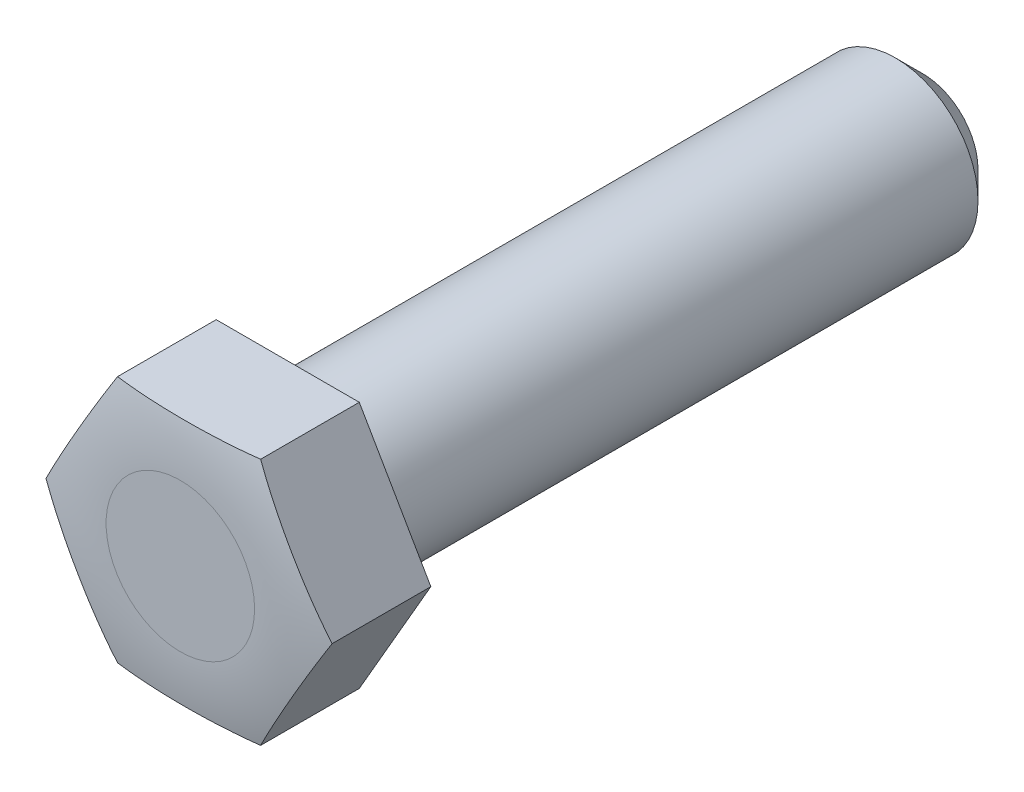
ISO-10303-21;
HEADER;
FILE_DESCRIPTION(('STEP AP214'),'2;1');
FILE_NAME('part.step','',(''),(''),'','','');
FILE_SCHEMA(('AUTOMOTIVE_DESIGN { 1 0 10303 214 1 1 1 1 }'));
ENDSEC;
DATA;
#1=APPLICATION_CONTEXT('core data for automotive mechanical design processes');
#2=APPLICATION_PROTOCOL_DEFINITION('international standard','automotive_design',2000,#1);
#3=PRODUCT_CONTEXT('',#1,'mechanical');
#4=PRODUCT('Part','Part','',(#3));
#5=PRODUCT_RELATED_PRODUCT_CATEGORY('part','',(#4));
#6=PRODUCT_DEFINITION_FORMATION('','',#4);
#7=PRODUCT_DEFINITION_CONTEXT('part definition',#1,'design');
#8=PRODUCT_DEFINITION('design','',#6,#7);
#9=PRODUCT_DEFINITION_SHAPE('','',#8);
#10=(LENGTH_UNIT() NAMED_UNIT(*) SI_UNIT(.MILLI.,.METRE.));
#11=(NAMED_UNIT(*) PLANE_ANGLE_UNIT() SI_UNIT($,.RADIAN.));
#12=(NAMED_UNIT(*) SI_UNIT($,.STERADIAN.) SOLID_ANGLE_UNIT());
#13=UNCERTAINTY_MEASURE_WITH_UNIT(LENGTH_MEASURE(1.E-05),#10,'distance_accuracy_value','');
#14=(GEOMETRIC_REPRESENTATION_CONTEXT(3) GLOBAL_UNCERTAINTY_ASSIGNED_CONTEXT((#13)) GLOBAL_UNIT_ASSIGNED_CONTEXT((#10,
#11,#12)) REPRESENTATION_CONTEXT('',''));
#15=CARTESIAN_POINT('',(0.,0.,0.));
#16=DIRECTION('',(0.,0.,1.));
#17=DIRECTION('',(1.,0.,0.));
#18=AXIS2_PLACEMENT_3D('',#15,#16,#17);
#19=CARTESIAN_POINT('',(-61.8038475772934,61.,17.9));
#20=DIRECTION('',(0.866025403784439,-0.5,0.));
#21=DIRECTION('',(0.5,0.866025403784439,0.));
#22=AXIS2_PLACEMENT_3D('',#19,#20,#21);
#23=PLANE('',#22);
#24=DIRECTION('',(0.,0.,1.));
#25=VECTOR('',#24,1.);
#26=CARTESIAN_POINT('',(-56.6076951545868,70.,17.9));
#27=LINE('',#26,#25);
#28=CARTESIAN_POINT('',(-56.6076951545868,70.,17.9));
#29=VERTEX_POINT('',#28);
#30=CARTESIAN_POINT('',(-56.6076951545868,70.,25.0649167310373));
#31=VERTEX_POINT('',#30);
#32=EDGE_CURVE('E105',#29,#31,#27,.T.);
#33=ORIENTED_EDGE('',*,*,#32,.T.);
#34=CARTESIAN_POINT('',(-56.6075796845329,70.0002,25.0648869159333));
#35=CARTESIAN_POINT('',(-56.8232832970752,69.6265903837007,25.1205548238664));
#36=CARTESIAN_POINT('',(-57.039514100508,69.2520676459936,25.1673620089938));
#37=CARTESIAN_POINT('',(-57.4726069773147,68.5019287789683,25.2453412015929));
#38=CARTESIAN_POINT('',(-57.6894687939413,68.1263130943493,25.2765188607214));
#39=CARTESIAN_POINT('',(-58.122809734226,67.3757445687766,25.3252784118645));
#40=CARTESIAN_POINT('',(-58.3392876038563,67.0007938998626,25.3429067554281));
#41=CARTESIAN_POINT('',(-58.7724340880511,66.2505621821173,25.366229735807));
#42=CARTESIAN_POINT('',(-58.9891027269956,65.8752810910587,25.3719225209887));
#43=CARTESIAN_POINT('',(-59.4224400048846,65.1247189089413,25.3719225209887));
#44=CARTESIAN_POINT('',(-59.6391086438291,64.7494378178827,25.366229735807));
#45=CARTESIAN_POINT('',(-60.0722551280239,63.9992061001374,25.3429067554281));
#46=CARTESIAN_POINT('',(-60.2887329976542,63.6242554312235,25.3252784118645));
#47=CARTESIAN_POINT('',(-60.7220739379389,62.8736869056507,25.2765188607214));
#48=CARTESIAN_POINT('',(-60.9389357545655,62.4980712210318,25.2453412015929));
#49=CARTESIAN_POINT('',(-61.3720286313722,61.7479323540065,25.1673620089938));
#50=CARTESIAN_POINT('',(-61.588259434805,61.3734096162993,25.1205548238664));
#51=CARTESIAN_POINT('',(-61.8039630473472,60.9998,25.0648869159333));
#52=B_SPLINE_CURVE_WITH_KNOTS('',3,(#34,#35,#36,#37,#38,#39,#40,#41,#42,#43,#44,#45,#46,#47,#48,
#49,#50,#51),.UNSPECIFIED.,.F.,.F.,(4,2,2,2,2,2,2,2,4),(0.,1.30473262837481,2.60899312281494,
3.90876198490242,5.20873247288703,6.50870296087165,7.80847182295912,9.11273231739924,
10.4174649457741),.UNSPECIFIED.);
#53=CARTESIAN_POINT('',(-61.8038475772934,61.,25.0649167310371));
#54=VERTEX_POINT('',#53);
#55=EDGE_CURVE('E45',#31,#54,#52,.T.);
#56=ORIENTED_EDGE('',*,*,#55,.T.);
#57=DIRECTION('',(0.,0.,1.));
#58=VECTOR('',#57,1.);
#59=CARTESIAN_POINT('',(-61.8038475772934,61.,17.9));
#60=LINE('',#59,#58);
#61=CARTESIAN_POINT('',(-61.8038475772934,61.,17.9));
#62=VERTEX_POINT('',#61);
#63=EDGE_CURVE('E52',#62,#54,#60,.T.);
#64=ORIENTED_EDGE('',*,*,#63,.F.);
#65=DIRECTION('',(0.5,0.866025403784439,0.));
#66=VECTOR('',#65,1.);
#67=CARTESIAN_POINT('',(-61.8038475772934,61.,17.9));
#68=LINE('',#67,#66);
#69=EDGE_CURVE('E152',#62,#29,#68,.T.);
#70=ORIENTED_EDGE('',*,*,#69,.T.);
#71=EDGE_LOOP('',(#33,#56,#64,#70));
#72=FACE_BOUND('',#71,.T.);
#73=ADVANCED_FACE('F30',(#72),#23,.T.);
#74=CARTESIAN_POINT('',(-72.1961524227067,61.,17.9));
#75=DIRECTION('',(0.,-1.,0.));
#76=DIRECTION('',(0.,0.,-1.));
#77=AXIS2_PLACEMENT_3D('',#74,#75,#76);
#78=PLANE('',#77);
#79=ORIENTED_EDGE('',*,*,#63,.T.);
#80=CARTESIAN_POINT('',(-67.,61.,25.3719225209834));
#81=CARTESIAN_POINT('',(-67.3831145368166,61.,25.371920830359));
#82=CARTESIAN_POINT('',(-67.766227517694,61.,25.3674640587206));
#83=CARTESIAN_POINT('',(-68.5322372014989,61.,25.349296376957));
#84=CARTESIAN_POINT('',(-68.9151339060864,61.,25.3355855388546));
#85=CARTESIAN_POINT('',(-69.6804102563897,61.,25.2979809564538));
#86=CARTESIAN_POINT('',(-70.0627899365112,61.,25.2740879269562));
#87=CARTESIAN_POINT('',(-70.8266516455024,61.,25.2147882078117));
#88=CARTESIAN_POINT('',(-71.2081337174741,61.,25.179382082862));
#89=CARTESIAN_POINT('',(-71.9675904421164,61.,25.0957858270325));
#90=CARTESIAN_POINT('',(-72.3455728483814,61.,25.0476670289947));
#91=CARTESIAN_POINT('',(-73.0994589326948,61.,24.9371088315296));
#92=CARTESIAN_POINT('',(-73.4753625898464,61.,24.8746692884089));
#93=CARTESIAN_POINT('',(-74.2241511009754,61.,24.7341924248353));
#94=CARTESIAN_POINT('',(-74.5970368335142,61.,24.6561598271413));
#95=CARTESIAN_POINT('',(-75.33889943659,61.,24.4834311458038));
#96=CARTESIAN_POINT('',(-75.7078765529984,61.,24.3887361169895));
#97=CARTESIAN_POINT('',(-76.6423851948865,61.,24.1249507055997));
#98=CARTESIAN_POINT('',(-77.2045186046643,61.,23.943572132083));
#99=CARTESIAN_POINT('',(-78.3126507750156,61.,23.5367792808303));
#100=CARTESIAN_POINT('',(-78.8586496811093,61.,23.311365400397));
#101=CARTESIAN_POINT('',(-79.930691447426,61.,22.8155216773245));
#102=CARTESIAN_POINT('',(-80.4567092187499,61.,22.5450373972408));
#103=CARTESIAN_POINT('',(-81.4834675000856,61.,21.9596505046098));
#104=CARTESIAN_POINT('',(-81.9842079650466,61.,21.6447478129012));
#105=CARTESIAN_POINT('',(-82.9578745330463,61.,20.9704606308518));
#106=CARTESIAN_POINT('',(-83.4306782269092,61.,20.6108991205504));
#107=CARTESIAN_POINT('',(-84.3418320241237,61.,19.8504295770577));
#108=CARTESIAN_POINT('',(-84.7801811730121,61.,19.44952039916));
#109=CARTESIAN_POINT('',(-85.6182007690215,61.,18.6092187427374));
#110=CARTESIAN_POINT('',(-86.0178764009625,61.,18.1698314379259));
#111=CARTESIAN_POINT('',(-86.7747727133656,61.,17.2559128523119));
#112=CARTESIAN_POINT('',(-87.1319965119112,61.,16.7813841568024));
#113=CARTESIAN_POINT('',(-87.7744455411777,61.,15.8393537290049));
#114=CARTESIAN_POINT('',(-88.0631146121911,61.,15.3741962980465));
#115=CARTESIAN_POINT('',(-88.5990929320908,61.,14.4206453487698));
#116=CARTESIAN_POINT('',(-88.8464044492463,61.,13.9322531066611));
#117=CARTESIAN_POINT('',(-89.2975706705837,61.,12.9359572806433));
#118=CARTESIAN_POINT('',(-89.5014375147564,61.,12.4280591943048));
#119=CARTESIAN_POINT('',(-89.8641178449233,61.,11.3964192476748));
#120=CARTESIAN_POINT('',(-90.0229317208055,61.,10.8726775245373));
#121=CARTESIAN_POINT('',(-90.2901757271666,61.,9.8290068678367));
#122=CARTESIAN_POINT('',(-90.3999574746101,61.,9.30942356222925));
#123=CARTESIAN_POINT('',(-90.5750009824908,61.,8.26281788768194));
#124=CARTESIAN_POINT('',(-90.6402638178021,61.,7.73579569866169));
#125=CARTESIAN_POINT('',(-90.7257621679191,61.,6.67810553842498));
#126=CARTESIAN_POINT('',(-90.7459971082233,61.,6.14743752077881));
#127=CARTESIAN_POINT('',(-90.7412799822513,61.,5.08630069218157));
#128=CARTESIAN_POINT('',(-90.7163279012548,61.,4.55583188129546));
#129=CARTESIAN_POINT('',(-90.6218282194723,61.,3.50334340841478));
#130=CARTESIAN_POINT('',(-90.5526540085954,61.,2.98129017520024));
#131=CARTESIAN_POINT('',(-90.3705940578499,61.,1.94486689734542));
#132=CARTESIAN_POINT('',(-90.2577086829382,61.,1.4304967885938));
#133=CARTESIAN_POINT('',(-89.9891181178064,61.,0.413164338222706));
#134=CARTESIAN_POINT('',(-89.8334207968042,61.,-0.0898000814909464));
#135=CARTESIAN_POINT('',(-89.4803911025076,61.,-1.08089675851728));
#136=CARTESIAN_POINT('',(-89.283058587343,61.,-1.56902896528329));
#137=CARTESIAN_POINT('',(-88.8478396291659,61.,-2.52802626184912));
#138=CARTESIAN_POINT('',(-88.6098738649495,61.,-2.99885534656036));
#139=CARTESIAN_POINT('',(-88.095484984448,61.,-3.91900696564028));
#140=CARTESIAN_POINT('',(-87.8190619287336,61.,-4.36832953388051));
#141=CARTESIAN_POINT('',(-87.2297265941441,61.,-5.24268247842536));
#142=CARTESIAN_POINT('',(-86.916796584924,61.,-5.66770090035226));
#143=CARTESIAN_POINT('',(-86.2569384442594,61.,-6.49046322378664));
#144=CARTESIAN_POINT('',(-85.9100099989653,61.,-6.88820687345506));
#145=CARTESIAN_POINT('',(-85.179478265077,61.,-7.65956878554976));
#146=CARTESIAN_POINT('',(-84.7954131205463,61.,-8.03274955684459));
#147=CARTESIAN_POINT('',(-83.9979563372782,61.,-8.74631547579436));
#148=CARTESIAN_POINT('',(-83.5845645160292,61.,-9.08670041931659));
#149=CARTESIAN_POINT('',(-82.7322049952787,61.,-9.73245105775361));
#150=CARTESIAN_POINT('',(-82.2932735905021,61.,-10.0378647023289));
#151=CARTESIAN_POINT('',(-81.3926104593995,61.,-10.6129287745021));
#152=CARTESIAN_POINT('',(-80.9308787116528,61.,-10.8825791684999));
#153=CARTESIAN_POINT('',(-79.9688158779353,61.,-11.3956077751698));
#154=CARTESIAN_POINT('',(-79.4676787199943,61.,-11.637473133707));
#155=CARTESIAN_POINT('',(-78.4481689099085,61.,-12.0816077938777));
#156=CARTESIAN_POINT('',(-77.9297950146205,61.,-12.2838742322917));
#157=CARTESIAN_POINT('',(-76.8782681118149,61.,-12.6500587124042));
#158=CARTESIAN_POINT('',(-76.3450810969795,61.,-12.8138786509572));
#159=CARTESIAN_POINT('',(-75.2688454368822,61.,-13.1043219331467));
#160=CARTESIAN_POINT('',(-74.7257985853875,61.,-13.2309519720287));
#161=CARTESIAN_POINT('',(-73.6713287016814,61.,-13.4423289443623));
#162=CARTESIAN_POINT('',(-73.1603631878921,61.,-13.5293927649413));
#163=CARTESIAN_POINT('',(-72.1345792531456,61.,-13.6772011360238));
#164=CARTESIAN_POINT('',(-71.6197599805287,61.,-13.737939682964));
#165=CARTESIAN_POINT('',(-70.5871586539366,61.,-13.8368617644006));
#166=CARTESIAN_POINT('',(-70.0693731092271,61.,-13.875007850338));
#167=CARTESIAN_POINT('',(-69.032804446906,61.,-13.9321559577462));
#168=CARTESIAN_POINT('',(-68.514021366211,61.,-13.9511586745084));
#169=CARTESIAN_POINT('',(-67.4750357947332,61.,-13.972435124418));
#170=CARTESIAN_POINT('',(-66.9548326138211,61.,-13.974673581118));
#171=CARTESIAN_POINT('',(-65.9145851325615,61.,-13.9626497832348));
#172=CARTESIAN_POINT('',(-65.394540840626,61.,-13.9483867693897));
#173=CARTESIAN_POINT('',(-64.3559103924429,61.,-13.9014862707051));
#174=CARTESIAN_POINT('',(-63.8373232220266,61.,-13.8688722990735));
#175=CARTESIAN_POINT('',(-62.80202652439,61.,-13.7819401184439));
#176=CARTESIAN_POINT('',(-62.2853166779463,61.,-13.7276257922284));
#177=CARTESIAN_POINT('',(-61.1415597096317,61.,-13.5787017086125));
#178=CARTESIAN_POINT('',(-60.5152953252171,61.,-13.477849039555));
#179=CARTESIAN_POINT('',(-59.2713731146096,61.,-13.2320656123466));
#180=CARTESIAN_POINT('',(-58.653714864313,61.,-13.087137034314));
#181=CARTESIAN_POINT('',(-57.4344737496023,61.,-12.74965285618));
#182=CARTESIAN_POINT('',(-56.8328301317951,61.,-12.5573188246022));
#183=CARTESIAN_POINT('',(-55.6479046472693,61.,-12.1222631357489));
#184=CARTESIAN_POINT('',(-55.0646238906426,61.,-11.8795384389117));
#185=CARTESIAN_POINT('',(-53.9159957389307,61.,-11.3401109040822));
#186=CARTESIAN_POINT('',(-53.3509012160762,61.,-11.0428676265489));
#187=CARTESIAN_POINT('',(-52.2509408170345,61.,-10.3967791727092));
#188=CARTESIAN_POINT('',(-51.7160756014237,61.,-10.0479328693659));
#189=CARTESIAN_POINT('',(-50.681121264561,61.,-9.29968096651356));
#190=CARTESIAN_POINT('',(-50.1811112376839,61.,-8.90016582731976));
#191=CARTESIAN_POINT('',(-49.2226364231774,61.,-8.05408618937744));
#192=CARTESIAN_POINT('',(-48.7641671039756,61.,-7.60752683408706));
#193=CARTESIAN_POINT('',(-47.9447257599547,61.,-6.72591983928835));
#194=CARTESIAN_POINT('',(-47.5786216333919,61.,-6.29562964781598));
#195=CARTESIAN_POINT('',(-46.8859036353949,61.,-5.40437743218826));
#196=CARTESIAN_POINT('',(-46.559286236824,61.,-4.9434181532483));
#197=CARTESIAN_POINT('',(-45.9487096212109,61.,-3.99476957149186));
#198=CARTESIAN_POINT('',(-45.6647046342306,61.,-3.50710972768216));
#199=CARTESIAN_POINT('',(-45.1414123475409,61.,-2.50835301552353));
#200=CARTESIAN_POINT('',(-44.902124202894,61.,-1.99725659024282));
#201=CARTESIAN_POINT('',(-44.4813599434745,61.,-0.982188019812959));
#202=CARTESIAN_POINT('',(-44.2975614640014,61.,-0.479176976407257));
#203=CARTESIAN_POINT('',(-43.9735907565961,61.,0.540691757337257));
#204=CARTESIAN_POINT('',(-43.833416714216,61.,1.05754887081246));
#205=CARTESIAN_POINT('',(-43.5977896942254,61.,2.10141541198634));
#206=CARTESIAN_POINT('',(-43.5023414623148,61.,2.62842591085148));
#207=CARTESIAN_POINT('',(-43.356945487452,61.,3.68869047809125));
#208=CARTESIAN_POINT('',(-43.3069977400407,61.,4.22194454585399));
#209=CARTESIAN_POINT('',(-43.2533993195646,61.,5.28285400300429));
#210=CARTESIAN_POINT('',(-43.2490743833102,61.,5.81047544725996));
#211=CARTESIAN_POINT('',(-43.2850049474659,61.,6.86419306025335));
#212=CARTESIAN_POINT('',(-43.3252598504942,61.,7.39028924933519));
#213=CARTESIAN_POINT('',(-43.4500341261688,61.,8.43716423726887));
#214=CARTESIAN_POINT('',(-43.5345501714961,61.,8.95794343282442));
#215=CARTESIAN_POINT('',(-43.7471930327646,61.,9.99052062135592));
#216=CARTESIAN_POINT('',(-43.875319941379,61.,10.5023185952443));
#217=CARTESIAN_POINT('',(-44.1739193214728,61.,11.5123724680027));
#218=CARTESIAN_POINT('',(-44.3443127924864,61.,12.0106517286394));
#219=CARTESIAN_POINT('',(-44.7262573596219,61.,12.9911722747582));
#220=CARTESIAN_POINT('',(-44.9378083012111,61.,13.4734136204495));
#221=CARTESIAN_POINT('',(-45.4004418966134,61.,14.4185216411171));
#222=CARTESIAN_POINT('',(-45.6515232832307,61.,14.8813889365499));
#223=CARTESIAN_POINT('',(-46.1913067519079,61.,15.7846364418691));
#224=CARTESIAN_POINT('',(-46.4800090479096,61.,16.2250165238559));
#225=CARTESIAN_POINT('',(-47.0953962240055,61.,17.0839568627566));
#226=CARTESIAN_POINT('',(-47.4223777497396,61.,17.5023045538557));
#227=CARTESIAN_POINT('',(-48.1098434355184,61.,18.3104888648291));
#228=CARTESIAN_POINT('',(-48.4703277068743,61.,18.7003253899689));
#229=CARTESIAN_POINT('',(-49.2221136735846,61.,19.4491830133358));
#230=CARTESIAN_POINT('',(-49.6134210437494,61.,19.8081984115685));
#231=CARTESIAN_POINT('',(-50.4238300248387,61.,20.4933292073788));
#232=CARTESIAN_POINT('',(-50.8429318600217,61.,20.8194443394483));
#233=CARTESIAN_POINT('',(-51.7174914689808,61.,21.4455655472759));
#234=CARTESIAN_POINT('',(-52.1736264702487,61.,21.744625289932));
#235=CARTESIAN_POINT('',(-53.1083878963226,61.,22.3051984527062));
#236=CARTESIAN_POINT('',(-53.587014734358,61.,22.5667111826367));
#237=CARTESIAN_POINT('',(-54.5625434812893,61.,23.0513493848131));
#238=CARTESIAN_POINT('',(-55.0594222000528,61.,23.2745216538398));
#239=CARTESIAN_POINT('',(-56.068468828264,61.,23.6830786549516));
#240=CARTESIAN_POINT('',(-56.5806371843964,61.,23.8684622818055));
#241=CARTESIAN_POINT('',(-57.495105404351,61.,24.1632828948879));
#242=CARTESIAN_POINT('',(-57.8949811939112,61.,24.2803330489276));
#243=CARTESIAN_POINT('',(-58.7002440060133,61.,24.4938128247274));
#244=CARTESIAN_POINT('',(-59.1056316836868,61.,24.5902399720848));
#245=CARTESIAN_POINT('',(-59.9207432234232,61.,24.7637019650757));
#246=CARTESIAN_POINT('',(-60.3304693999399,61.,24.8407258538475));
#247=CARTESIAN_POINT('',(-61.1528497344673,61.,24.9768635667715));
#248=CARTESIAN_POINT('',(-61.5655038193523,61.,25.0359778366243));
#249=CARTESIAN_POINT('',(-62.3953110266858,61.,25.1384395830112));
#250=CARTESIAN_POINT('',(-62.8124762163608,61.,25.1816880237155));
#251=CARTESIAN_POINT('',(-63.6480474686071,61.,25.2538918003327));
#252=CARTESIAN_POINT('',(-64.0664536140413,61.,25.2828461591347));
#253=CARTESIAN_POINT('',(-64.9039105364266,61.,25.3282846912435));
#254=CARTESIAN_POINT('',(-65.3229612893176,61.,25.3447693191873));
#255=CARTESIAN_POINT('',(-66.1613419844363,61.,25.3665891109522));
#256=CARTESIAN_POINT('',(-66.5806719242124,61.,25.3719243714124));
#257=CARTESIAN_POINT('',(-67.,61.,25.3719225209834));
#258=B_SPLINE_CURVE_WITH_KNOTS('',3,(#80,#81,#82,#83,#84,#85,#86,#87,#88,#89,#90,#91,#92,#93,
#94,#95,#96,#97,#98,#99,#100,#101,#102,#103,#104,#105,#106,#107,#108,#109,#110,#111,#112,#113,
#114,#115,#116,#117,#118,#119,#120,#121,#122,#123,#124,#125,#126,#127,#128,#129,#130,#131,#132,
#133,#134,#135,#136,#137,#138,#139,#140,#141,#142,#143,#144,#145,#146,#147,#148,#149,#150,#151,
#152,#153,#154,#155,#156,#157,#158,#159,#160,#161,#162,#163,#164,#165,#166,#167,#168,#169,#170,
#171,#172,#173,#174,#175,#176,#177,#178,#179,#180,#181,#182,#183,#184,#185,#186,#187,#188,#189,
#190,#191,#192,#193,#194,#195,#196,#197,#198,#199,#200,#201,#202,#203,#204,#205,#206,#207,#208,
#209,#210,#211,#212,#213,#214,#215,#216,#217,#218,#219,#220,#221,#222,#223,#224,#225,#226,#227,
#228,#229,#230,#231,#232,#233,#234,#235,#236,#237,#238,#239,#240,#241,#242,#243,#244,#245,#246,
#247,#248,#249,#250,#251,#252,#253,#254,#255,#256,#257),.UNSPECIFIED.,.T.,.F.,(4,2,2,2,2,2,2,2,
2,2,2,2,2,2,2,2,2,2,2,2,2,2,2,2,2,2,2,2,2,2,2,2,2,2,2,2,2,2,2,2,2,2,2,2,2,2,2,2,2,2,2,2,2,2,2,2,
2,2,2,2,2,2,2,2,2,2,2,2,2,2,2,2,2,2,2,2,2,2,2,2,2,2,2,2,2,2,2,2,4),(0.,1.14931363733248,
2.29861832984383,3.4478423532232,4.59701001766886,5.73986164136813,6.88272473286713,
8.0252422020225,9.16768736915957,10.9378625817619,12.7080218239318,14.4803348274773,
16.2526509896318,18.0322310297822,19.8118603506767,21.5912507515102,23.3705103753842,
25.0108451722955,26.651089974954,28.2908758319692,29.9306474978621,31.5219057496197,
33.1131255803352,34.704365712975,36.295606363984,37.8735856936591,39.4515518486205,
41.0292281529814,42.6069098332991,44.1877073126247,45.7685023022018,47.3500682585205,
48.9316488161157,50.5363415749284,52.1410443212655,53.7435198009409,55.3459967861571,
57.0135916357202,58.6813070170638,60.3532326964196,62.0248571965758,63.5790829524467,
65.1336629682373,66.6908126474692,68.2479057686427,69.8082745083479,71.36871504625,
72.9271607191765,74.4853276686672,76.3869317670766,78.2884418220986,80.1812275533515,
82.0741274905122,83.9869195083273,85.8997533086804,87.8167952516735,89.7336278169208,
91.4263690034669,93.1189588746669,94.8097175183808,96.5004442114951,98.1051289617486,
99.7097469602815,101.314535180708,102.919323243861,104.500360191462,106.081375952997,
107.662272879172,109.24317316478,110.821140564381,112.399102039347,113.977012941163,
115.554932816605,117.146010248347,118.737092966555,120.328469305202,121.919858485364,
123.554347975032,125.188867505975,126.821377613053,128.453935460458,129.70335847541,
130.952931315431,132.203208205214,133.453453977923,134.711376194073,135.969384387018,
137.227346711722,138.485298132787),.UNSPECIFIED.);
#259=CARTESIAN_POINT('',(-72.1961524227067,61.0000000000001,25.0649167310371));
#260=VERTEX_POINT('',#259);
#261=EDGE_CURVE('E153',#54,#260,#258,.T.);
#262=ORIENTED_EDGE('',*,*,#261,.T.);
#263=DIRECTION('',(0.,0.,1.));
#264=VECTOR('',#263,1.);
#265=CARTESIAN_POINT('',(-72.1961524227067,61.,17.9));
#266=LINE('',#265,#264);
#267=CARTESIAN_POINT('',(-72.1961524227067,61.,17.9));
#268=VERTEX_POINT('',#267);
#269=EDGE_CURVE('E217',#268,#260,#266,.T.);
#270=ORIENTED_EDGE('',*,*,#269,.F.);
#271=DIRECTION('',(1.,0.,0.));
#272=VECTOR('',#271,1.);
#273=CARTESIAN_POINT('',(-72.1961524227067,61.,17.9));
#274=LINE('',#273,#272);
#275=EDGE_CURVE('E109',#268,#62,#274,.T.);
#276=ORIENTED_EDGE('',*,*,#275,.T.);
#277=EDGE_LOOP('',(#79,#262,#270,#276));
#278=FACE_BOUND('',#277,.T.);
#279=ADVANCED_FACE('F131',(#278),#78,.T.);
#280=CARTESIAN_POINT('',(-77.3923048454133,70.,17.9));
#281=DIRECTION('',(-0.866025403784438,-0.500000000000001,0.));
#282=DIRECTION('',(0.500000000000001,-0.866025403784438,0.));
#283=AXIS2_PLACEMENT_3D('',#280,#281,#282);
#284=PLANE('',#283);
#285=ORIENTED_EDGE('',*,*,#269,.T.);
#286=CARTESIAN_POINT('',(-72.1960369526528,60.9998,25.0648869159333));
#287=CARTESIAN_POINT('',(-72.411740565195,61.3734096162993,25.1205548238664));
#288=CARTESIAN_POINT('',(-72.6279713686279,61.7479323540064,25.1673620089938));
#289=CARTESIAN_POINT('',(-73.0610642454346,62.4980712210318,25.2453412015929));
#290=CARTESIAN_POINT('',(-73.2779260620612,62.8736869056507,25.2765188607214));
#291=CARTESIAN_POINT('',(-73.7112670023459,63.6242554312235,25.3252784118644));
#292=CARTESIAN_POINT('',(-73.9277448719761,63.9992061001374,25.3429067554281));
#293=CARTESIAN_POINT('',(-74.360891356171,64.7494378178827,25.366229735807));
#294=CARTESIAN_POINT('',(-74.5775599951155,65.1247189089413,25.3719225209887));
#295=CARTESIAN_POINT('',(-75.0108972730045,65.8752810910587,25.3719225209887));
#296=CARTESIAN_POINT('',(-75.227565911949,66.2505621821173,25.366229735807));
#297=CARTESIAN_POINT('',(-75.6607123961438,67.0007938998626,25.3429067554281));
#298=CARTESIAN_POINT('',(-75.8771902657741,67.3757445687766,25.3252784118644));
#299=CARTESIAN_POINT('',(-76.3105312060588,68.1263130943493,25.2765188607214));
#300=CARTESIAN_POINT('',(-76.5273930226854,68.5019287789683,25.2453412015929));
#301=CARTESIAN_POINT('',(-76.960485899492,69.2520676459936,25.1673620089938));
#302=CARTESIAN_POINT('',(-77.1767167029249,69.6265903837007,25.1205548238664));
#303=CARTESIAN_POINT('',(-77.3924203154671,70.0002,25.0648869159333));
#304=B_SPLINE_CURVE_WITH_KNOTS('',3,(#286,#287,#288,#289,#290,#291,#292,#293,#294,#295,#296,
#297,#298,#299,#300,#301,#302,#303),.UNSPECIFIED.,.F.,.F.,(4,2,2,2,2,2,2,2,4),(0.,
1.30473262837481,2.60899312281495,3.90876198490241,5.20873247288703,6.50870296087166,
7.80847182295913,9.11273231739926,10.4174649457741),.UNSPECIFIED.);
#305=CARTESIAN_POINT('',(-77.3923048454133,70.,25.0649167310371));
#306=VERTEX_POINT('',#305);
#307=EDGE_CURVE('E178',#260,#306,#304,.T.);
#308=ORIENTED_EDGE('',*,*,#307,.T.);
#309=DIRECTION('',(0.,0.,1.));
#310=VECTOR('',#309,1.);
#311=CARTESIAN_POINT('',(-77.3923048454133,70.,17.9));
#312=LINE('',#311,#310);
#313=CARTESIAN_POINT('',(-77.3923048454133,70.,17.9));
#314=VERTEX_POINT('',#313);
#315=EDGE_CURVE('E107',#314,#306,#312,.T.);
#316=ORIENTED_EDGE('',*,*,#315,.F.);
#317=DIRECTION('',(0.500000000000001,-0.866025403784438,0.));
#318=VECTOR('',#317,1.);
#319=CARTESIAN_POINT('',(-77.3923048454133,70.,17.9));
#320=LINE('',#319,#318);
#321=EDGE_CURVE('E219',#314,#268,#320,.T.);
#322=ORIENTED_EDGE('',*,*,#321,.T.);
#323=EDGE_LOOP('',(#285,#308,#316,#322));
#324=FACE_BOUND('',#323,.T.);
#325=ADVANCED_FACE('F136',(#324),#284,.T.);
#326=CARTESIAN_POINT('',(-72.1961524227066,79.,17.9));
#327=DIRECTION('',(-0.866025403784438,0.500000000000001,0.));
#328=DIRECTION('',(-0.500000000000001,-0.866025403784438,0.));
#329=AXIS2_PLACEMENT_3D('',#326,#327,#328);
#330=PLANE('',#329);
#331=ORIENTED_EDGE('',*,*,#315,.T.);
#332=CARTESIAN_POINT('',(-77.3924203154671,69.9998,25.0648869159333));
#333=CARTESIAN_POINT('',(-77.1767167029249,70.3734096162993,25.1205548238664));
#334=CARTESIAN_POINT('',(-76.960485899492,70.7479323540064,25.1673620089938));
#335=CARTESIAN_POINT('',(-76.5273930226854,71.4980712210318,25.2453412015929));
#336=CARTESIAN_POINT('',(-76.3105312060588,71.8736869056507,25.2765188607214));
#337=CARTESIAN_POINT('',(-75.8771902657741,72.6242554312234,25.3252784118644));
#338=CARTESIAN_POINT('',(-75.6607123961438,72.9992061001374,25.3429067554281));
#339=CARTESIAN_POINT('',(-75.227565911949,73.7494378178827,25.366229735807));
#340=CARTESIAN_POINT('',(-75.0108972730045,74.1247189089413,25.3719225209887));
#341=CARTESIAN_POINT('',(-74.5775599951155,74.8752810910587,25.3719225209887));
#342=CARTESIAN_POINT('',(-74.360891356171,75.2505621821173,25.366229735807));
#343=CARTESIAN_POINT('',(-73.9277448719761,76.0007938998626,25.3429067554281));
#344=CARTESIAN_POINT('',(-73.7112670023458,76.3757445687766,25.3252784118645));
#345=CARTESIAN_POINT('',(-73.2779260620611,77.1263130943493,25.2765188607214));
#346=CARTESIAN_POINT('',(-73.0610642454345,77.5019287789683,25.2453412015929));
#347=CARTESIAN_POINT('',(-72.6279713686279,78.2520676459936,25.1673620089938));
#348=CARTESIAN_POINT('',(-72.411740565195,78.6265903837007,25.1205548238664));
#349=CARTESIAN_POINT('',(-72.1960369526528,79.0002,25.0648869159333));
#350=B_SPLINE_CURVE_WITH_KNOTS('',3,(#332,#333,#334,#335,#336,#337,#338,#339,#340,#341,#342,
#343,#344,#345,#346,#347,#348,#349),.UNSPECIFIED.,.F.,.F.,(4,2,2,2,2,2,2,2,4),(0.,
1.30473262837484,2.60899312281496,3.90876198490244,5.20873247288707,6.50870296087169,
7.80847182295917,9.11273231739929,10.4174649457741),.UNSPECIFIED.);
#351=CARTESIAN_POINT('',(-72.1961524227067,79.,25.0649167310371));
#352=VERTEX_POINT('',#351);
#353=EDGE_CURVE('E99',#306,#352,#350,.T.);
#354=ORIENTED_EDGE('',*,*,#353,.T.);
#355=DIRECTION('',(0.,0.,1.));
#356=VECTOR('',#355,1.);
#357=CARTESIAN_POINT('',(-72.1961524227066,79.,17.9));
#358=LINE('',#357,#356);
#359=CARTESIAN_POINT('',(-72.1961524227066,79.,17.9));
#360=VERTEX_POINT('',#359);
#361=EDGE_CURVE('E98',#360,#352,#358,.T.);
#362=ORIENTED_EDGE('',*,*,#361,.F.);
#363=DIRECTION('',(-0.500000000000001,-0.866025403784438,0.));
#364=VECTOR('',#363,1.);
#365=CARTESIAN_POINT('',(-72.1961524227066,79.,17.9));
#366=LINE('',#365,#364);
#367=EDGE_CURVE('E221',#360,#314,#366,.T.);
#368=ORIENTED_EDGE('',*,*,#367,.T.);
#369=EDGE_LOOP('',(#331,#354,#362,#368));
#370=FACE_BOUND('',#369,.T.);
#371=ADVANCED_FACE('F186',(#370),#330,.T.);
#372=CARTESIAN_POINT('',(-61.8038475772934,79.,17.9));
#373=DIRECTION('',(0.,1.,0.));
#374=DIRECTION('',(0.,0.,1.));
#375=AXIS2_PLACEMENT_3D('',#372,#373,#374);
#376=PLANE('',#375);
#377=ORIENTED_EDGE('',*,*,#361,.T.);
#378=CARTESIAN_POINT('',(-67.,79.,25.3719225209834));
#379=CARTESIAN_POINT('',(-66.6168854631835,79.,25.371920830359));
#380=CARTESIAN_POINT('',(-66.2337724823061,79.,25.3674640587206));
#381=CARTESIAN_POINT('',(-65.4677627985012,79.,25.349296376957));
#382=CARTESIAN_POINT('',(-65.0848660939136,79.,25.3355855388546));
#383=CARTESIAN_POINT('',(-64.3195897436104,79.,25.2979809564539));
#384=CARTESIAN_POINT('',(-63.9372100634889,79.,25.2740879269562));
#385=CARTESIAN_POINT('',(-63.1733483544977,79.,25.2147882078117));
#386=CARTESIAN_POINT('',(-62.791866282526,79.,25.1793820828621));
#387=CARTESIAN_POINT('',(-62.0324095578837,79.,25.0957858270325));
#388=CARTESIAN_POINT('',(-61.6544271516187,79.,25.0476670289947));
#389=CARTESIAN_POINT('',(-60.9005410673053,79.,24.9371088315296));
#390=CARTESIAN_POINT('',(-60.5246374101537,79.,24.8746692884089));
#391=CARTESIAN_POINT('',(-59.7758488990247,79.,24.7341924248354));
#392=CARTESIAN_POINT('',(-59.4029631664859,79.,24.6561598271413));
#393=CARTESIAN_POINT('',(-58.6611005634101,79.,24.4834311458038));
#394=CARTESIAN_POINT('',(-58.2921234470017,79.,24.3887361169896));
#395=CARTESIAN_POINT('',(-57.3576148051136,79.,24.1249507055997));
#396=CARTESIAN_POINT('',(-56.7954813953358,79.,23.943572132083));
#397=CARTESIAN_POINT('',(-55.6873492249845,79.,23.5367792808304));
#398=CARTESIAN_POINT('',(-55.1413503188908,79.,23.3113654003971));
#399=CARTESIAN_POINT('',(-54.0693085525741,79.,22.8155216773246));
#400=CARTESIAN_POINT('',(-53.5432907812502,79.,22.5450373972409));
#401=CARTESIAN_POINT('',(-52.5165324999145,79.,21.9596505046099));
#402=CARTESIAN_POINT('',(-52.0157920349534,79.,21.6447478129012));
#403=CARTESIAN_POINT('',(-51.0421254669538,79.,20.9704606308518));
#404=CARTESIAN_POINT('',(-50.5693217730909,79.,20.6108991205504));
#405=CARTESIAN_POINT('',(-49.6581679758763,79.,19.8504295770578));
#406=CARTESIAN_POINT('',(-49.219818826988,79.,19.4495203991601));
#407=CARTESIAN_POINT('',(-48.3817992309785,79.,18.6092187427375));
#408=CARTESIAN_POINT('',(-47.9821235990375,79.,18.169831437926));
#409=CARTESIAN_POINT('',(-47.2252272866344,79.,17.255912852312));
#410=CARTESIAN_POINT('',(-46.8680034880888,79.,16.7813841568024));
#411=CARTESIAN_POINT('',(-46.2255544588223,79.,15.839353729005));
#412=CARTESIAN_POINT('',(-45.9368853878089,79.,15.3741962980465));
#413=CARTESIAN_POINT('',(-45.4009070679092,79.,14.4206453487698));
#414=CARTESIAN_POINT('',(-45.1535955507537,79.,13.9322531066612));
#415=CARTESIAN_POINT('',(-44.7024293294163,79.,12.9359572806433));
#416=CARTESIAN_POINT('',(-44.4985624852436,79.,12.4280591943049));
#417=CARTESIAN_POINT('',(-44.1358821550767,79.,11.3964192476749));
#418=CARTESIAN_POINT('',(-43.9770682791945,79.,10.8726775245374));
#419=CARTESIAN_POINT('',(-43.7098242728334,79.,9.82900686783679));
#420=CARTESIAN_POINT('',(-43.6000425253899,79.,9.30942356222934));
#421=CARTESIAN_POINT('',(-43.4249990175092,79.,8.26281788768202));
#422=CARTESIAN_POINT('',(-43.3597361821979,79.,7.73579569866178));
#423=CARTESIAN_POINT('',(-43.2742378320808,79.,6.67810553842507));
#424=CARTESIAN_POINT('',(-43.2540028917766,79.,6.14743752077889));
#425=CARTESIAN_POINT('',(-43.2587200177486,79.,5.08630069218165));
#426=CARTESIAN_POINT('',(-43.2836720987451,79.,4.55583188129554));
#427=CARTESIAN_POINT('',(-43.3781717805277,79.,3.50334340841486));
#428=CARTESIAN_POINT('',(-43.4473459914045,79.,2.98129017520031));
#429=CARTESIAN_POINT('',(-43.6294059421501,79.,1.9448668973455));
#430=CARTESIAN_POINT('',(-43.7422913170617,79.,1.43049678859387));
#431=CARTESIAN_POINT('',(-44.0108818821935,79.,0.413164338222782));
#432=CARTESIAN_POINT('',(-44.1665792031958,79.,-0.0898000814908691));
#433=CARTESIAN_POINT('',(-44.5196088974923,79.,-1.0808967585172));
#434=CARTESIAN_POINT('',(-44.7169414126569,79.,-1.56902896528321));
#435=CARTESIAN_POINT('',(-45.152160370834,79.,-2.52802626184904));
#436=CARTESIAN_POINT('',(-45.3901261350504,79.,-2.99885534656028));
#437=CARTESIAN_POINT('',(-45.9045150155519,79.,-3.91900696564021));
#438=CARTESIAN_POINT('',(-46.1809380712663,79.,-4.36832953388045));
#439=CARTESIAN_POINT('',(-46.7702734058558,79.,-5.24268247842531));
#440=CARTESIAN_POINT('',(-47.0832034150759,79.,-5.6677009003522));
#441=CARTESIAN_POINT('',(-47.7430615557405,79.,-6.49046322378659));
#442=CARTESIAN_POINT('',(-48.0899900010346,79.,-6.88820687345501));
#443=CARTESIAN_POINT('',(-48.8205217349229,79.,-7.65956878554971));
#444=CARTESIAN_POINT('',(-49.2045868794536,79.,-8.03274955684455));
#445=CARTESIAN_POINT('',(-50.0020436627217,79.,-8.74631547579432));
#446=CARTESIAN_POINT('',(-50.4154354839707,79.,-9.08670041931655));
#447=CARTESIAN_POINT('',(-51.2677950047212,79.,-9.73245105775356));
#448=CARTESIAN_POINT('',(-51.7067264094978,79.,-10.0378647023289));
#449=CARTESIAN_POINT('',(-52.6073895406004,79.,-10.6129287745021));
#450=CARTESIAN_POINT('',(-53.0691212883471,79.,-10.8825791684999));
#451=CARTESIAN_POINT('',(-54.0311841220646,79.,-11.3956077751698));
#452=CARTESIAN_POINT('',(-54.5323212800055,79.,-11.6374731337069));
#453=CARTESIAN_POINT('',(-55.5518310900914,79.,-12.0816077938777));
#454=CARTESIAN_POINT('',(-56.0702049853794,79.,-12.2838742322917));
#455=CARTESIAN_POINT('',(-57.121731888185,79.,-12.6500587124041));
#456=CARTESIAN_POINT('',(-57.6549189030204,79.,-12.8138786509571));
#457=CARTESIAN_POINT('',(-58.7311545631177,79.,-13.1043219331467));
#458=CARTESIAN_POINT('',(-59.2742014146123,79.,-13.2309519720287));
#459=CARTESIAN_POINT('',(-60.3286712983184,79.,-13.4423289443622));
#460=CARTESIAN_POINT('',(-60.8396368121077,79.,-13.5293927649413));
#461=CARTESIAN_POINT('',(-61.8654207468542,79.,-13.6772011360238));
#462=CARTESIAN_POINT('',(-62.3802400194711,79.,-13.737939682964));
#463=CARTESIAN_POINT('',(-63.4128413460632,79.,-13.8368617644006));
#464=CARTESIAN_POINT('',(-63.9306268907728,79.,-13.875007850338));
#465=CARTESIAN_POINT('',(-64.9671955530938,79.,-13.9321559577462));
#466=CARTESIAN_POINT('',(-65.4859786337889,79.,-13.9511586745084));
#467=CARTESIAN_POINT('',(-66.5249642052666,79.,-13.972435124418));
#468=CARTESIAN_POINT('',(-67.0451673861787,79.,-13.974673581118));
#469=CARTESIAN_POINT('',(-68.0854148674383,79.,-13.9626497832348));
#470=CARTESIAN_POINT('',(-68.6054591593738,79.,-13.9483867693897));
#471=CARTESIAN_POINT('',(-69.6440896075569,79.,-13.9014862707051));
#472=CARTESIAN_POINT('',(-70.1626767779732,79.,-13.8688722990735));
#473=CARTESIAN_POINT('',(-71.1979734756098,79.,-13.7819401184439));
#474=CARTESIAN_POINT('',(-71.7146833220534,79.,-13.7276257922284));
#475=CARTESIAN_POINT('',(-72.8584402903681,79.,-13.5787017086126));
#476=CARTESIAN_POINT('',(-73.4847046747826,79.,-13.477849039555));
#477=CARTESIAN_POINT('',(-74.7286268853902,79.,-13.2320656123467));
#478=CARTESIAN_POINT('',(-75.3462851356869,79.,-13.0871370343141));
#479=CARTESIAN_POINT('',(-76.5655262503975,79.,-12.7496528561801));
#480=CARTESIAN_POINT('',(-77.1671698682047,79.,-12.5573188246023));
#481=CARTESIAN_POINT('',(-78.3520953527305,79.,-12.122263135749));
#482=CARTESIAN_POINT('',(-78.9353761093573,79.,-11.8795384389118));
#483=CARTESIAN_POINT('',(-80.0840042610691,79.,-11.3401109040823));
#484=CARTESIAN_POINT('',(-80.6490987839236,79.,-11.042867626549));
#485=CARTESIAN_POINT('',(-81.7490591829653,79.,-10.3967791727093));
#486=CARTESIAN_POINT('',(-82.2839243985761,79.,-10.047932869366));
#487=CARTESIAN_POINT('',(-83.3188787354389,79.,-9.29968096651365));
#488=CARTESIAN_POINT('',(-83.818888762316,79.,-8.90016582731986));
#489=CARTESIAN_POINT('',(-84.7773635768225,79.,-8.05408618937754));
#490=CARTESIAN_POINT('',(-85.2358328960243,79.,-7.60752683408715));
#491=CARTESIAN_POINT('',(-86.0552742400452,79.,-6.72591983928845));
#492=CARTESIAN_POINT('',(-86.4213783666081,79.,-6.29562964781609));
#493=CARTESIAN_POINT('',(-87.1140963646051,79.,-5.40437743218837));
#494=CARTESIAN_POINT('',(-87.4407137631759,79.,-4.9434181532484));
#495=CARTESIAN_POINT('',(-88.0512903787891,79.,-3.99476957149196));
#496=CARTESIAN_POINT('',(-88.3352953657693,79.,-3.50710972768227));
#497=CARTESIAN_POINT('',(-88.858587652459,79.,-2.50835301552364));
#498=CARTESIAN_POINT('',(-89.097875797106,79.,-1.99725659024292));
#499=CARTESIAN_POINT('',(-89.5186400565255,79.,-0.982188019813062));
#500=CARTESIAN_POINT('',(-89.7024385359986,79.,-0.479176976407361));
#501=CARTESIAN_POINT('',(-90.0264092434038,79.,0.54069175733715));
#502=CARTESIAN_POINT('',(-90.166583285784,79.,1.05754887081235));
#503=CARTESIAN_POINT('',(-90.4022103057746,79.,2.10141541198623));
#504=CARTESIAN_POINT('',(-90.4976585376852,79.,2.62842591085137));
#505=CARTESIAN_POINT('',(-90.6430545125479,79.,3.68869047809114));
#506=CARTESIAN_POINT('',(-90.6930022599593,79.,4.22194454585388));
#507=CARTESIAN_POINT('',(-90.7466006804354,79.,5.28285400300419));
#508=CARTESIAN_POINT('',(-90.7509256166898,79.,5.81047544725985));
#509=CARTESIAN_POINT('',(-90.7149950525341,79.,6.86419306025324));
#510=CARTESIAN_POINT('',(-90.6747401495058,79.,7.39028924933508));
#511=CARTESIAN_POINT('',(-90.5499658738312,79.,8.43716423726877));
#512=CARTESIAN_POINT('',(-90.4654498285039,79.,8.95794343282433));
#513=CARTESIAN_POINT('',(-90.2528069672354,79.,9.99052062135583));
#514=CARTESIAN_POINT('',(-90.124680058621,79.,10.5023185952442));
#515=CARTESIAN_POINT('',(-89.8260806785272,79.,11.5123724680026));
#516=CARTESIAN_POINT('',(-89.6556872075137,79.,12.0106517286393));
#517=CARTESIAN_POINT('',(-89.2737426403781,79.,12.9911722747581));
#518=CARTESIAN_POINT('',(-89.062191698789,79.,13.4734136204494));
#519=CARTESIAN_POINT('',(-88.5995581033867,79.,14.418521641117));
#520=CARTESIAN_POINT('',(-88.3484767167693,79.,14.8813889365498));
#521=CARTESIAN_POINT('',(-87.8086932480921,79.,15.784636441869));
#522=CARTESIAN_POINT('',(-87.5199909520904,79.,16.2250165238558));
#523=CARTESIAN_POINT('',(-86.9046037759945,79.,17.0839568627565));
#524=CARTESIAN_POINT('',(-86.5776222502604,79.,17.5023045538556));
#525=CARTESIAN_POINT('',(-85.8901565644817,79.,18.3104888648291));
#526=CARTESIAN_POINT('',(-85.5296722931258,79.,18.7003253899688));
#527=CARTESIAN_POINT('',(-84.7778863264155,79.,19.4491830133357));
#528=CARTESIAN_POINT('',(-84.3865789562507,79.,19.8081984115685));
#529=CARTESIAN_POINT('',(-83.5761699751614,79.,20.4933292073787));
#530=CARTESIAN_POINT('',(-83.1570681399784,79.,20.8194443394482));
#531=CARTESIAN_POINT('',(-82.2825085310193,79.,21.4455655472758));
#532=CARTESIAN_POINT('',(-81.8263735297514,79.,21.7446252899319));
#533=CARTESIAN_POINT('',(-80.8916121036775,79.,22.3051984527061));
#534=CARTESIAN_POINT('',(-80.4129852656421,79.,22.5667111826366));
#535=CARTESIAN_POINT('',(-79.4374565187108,79.,23.0513493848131));
#536=CARTESIAN_POINT('',(-78.9405777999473,79.,23.2745216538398));
#537=CARTESIAN_POINT('',(-77.9315311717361,79.,23.6830786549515));
#538=CARTESIAN_POINT('',(-77.4193628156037,79.,23.8684622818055));
#539=CARTESIAN_POINT('',(-76.5048945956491,79.,24.1632828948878));
#540=CARTESIAN_POINT('',(-76.1050188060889,79.,24.2803330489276));
#541=CARTESIAN_POINT('',(-75.2997559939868,79.,24.4938128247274));
#542=CARTESIAN_POINT('',(-74.8943683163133,79.,24.5902399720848));
#543=CARTESIAN_POINT('',(-74.0792567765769,79.,24.7637019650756));
#544=CARTESIAN_POINT('',(-73.6695306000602,79.,24.8407258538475));
#545=CARTESIAN_POINT('',(-72.8471502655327,79.,24.9768635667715));
#546=CARTESIAN_POINT('',(-72.4344961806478,79.,25.0359778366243));
#547=CARTESIAN_POINT('',(-71.6046889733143,79.,25.1384395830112));
#548=CARTESIAN_POINT('',(-71.1875237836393,79.,25.1816880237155));
#549=CARTESIAN_POINT('',(-70.3519525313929,79.,25.2538918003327));
#550=CARTESIAN_POINT('',(-69.9335463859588,79.,25.2828461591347));
#551=CARTESIAN_POINT('',(-69.0960894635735,79.,25.3282846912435));
#552=CARTESIAN_POINT('',(-68.6770387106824,79.,25.3447693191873));
#553=CARTESIAN_POINT('',(-67.8386580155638,79.,25.3665891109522));
#554=CARTESIAN_POINT('',(-67.4193280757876,79.,25.3719243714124));
#555=CARTESIAN_POINT('',(-67.,79.,25.3719225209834));
#556=B_SPLINE_CURVE_WITH_KNOTS('',3,(#378,#379,#380,#381,#382,#383,#384,#385,#386,#387,#388,
#389,#390,#391,#392,#393,#394,#395,#396,#397,#398,#399,#400,#401,#402,#403,#404,#405,#406,#407,
#408,#409,#410,#411,#412,#413,#414,#415,#416,#417,#418,#419,#420,#421,#422,#423,#424,#425,#426,
#427,#428,#429,#430,#431,#432,#433,#434,#435,#436,#437,#438,#439,#440,#441,#442,#443,#444,#445,
#446,#447,#448,#449,#450,#451,#452,#453,#454,#455,#456,#457,#458,#459,#460,#461,#462,#463,#464,
#465,#466,#467,#468,#469,#470,#471,#472,#473,#474,#475,#476,#477,#478,#479,#480,#481,#482,#483,
#484,#485,#486,#487,#488,#489,#490,#491,#492,#493,#494,#495,#496,#497,#498,#499,#500,#501,#502,
#503,#504,#505,#506,#507,#508,#509,#510,#511,#512,#513,#514,#515,#516,#517,#518,#519,#520,#521,
#522,#523,#524,#525,#526,#527,#528,#529,#530,#531,#532,#533,#534,#535,#536,#537,#538,#539,#540,
#541,#542,#543,#544,#545,#546,#547,#548,#549,#550,#551,#552,#553,#554,#555),.UNSPECIFIED.,.T.,
.F.,(4,2,2,2,2,2,2,2,2,2,2,2,2,2,2,2,2,2,2,2,2,2,2,2,2,2,2,2,2,2,2,2,2,2,2,2,2,2,2,2,2,2,2,2,2,
2,2,2,2,2,2,2,2,2,2,2,2,2,2,2,2,2,2,2,2,2,2,2,2,2,2,2,2,2,2,2,2,2,2,2,2,2,2,2,2,2,2,2,4),(0.,
1.14931363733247,2.29861832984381,3.44784235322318,4.59701001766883,5.73986164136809,
6.88272473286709,8.02524220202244,9.16768736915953,10.9378625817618,12.7080218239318,
14.4803348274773,16.2526509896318,18.0322310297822,19.8118603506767,21.5912507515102,
23.3705103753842,25.0108451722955,26.651089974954,28.2908758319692,29.9306474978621,
31.5219057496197,33.1131255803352,34.704365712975,36.295606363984,37.8735856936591,
39.4515518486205,41.0292281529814,42.6069098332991,44.1877073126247,45.7685023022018,
47.3500682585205,48.9316488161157,50.5363415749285,52.1410443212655,53.7435198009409,
55.3459967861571,57.0135916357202,58.6813070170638,60.3532326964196,62.0248571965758,
63.5790829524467,65.1336629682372,66.6908126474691,68.2479057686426,69.8082745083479,
71.36871504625,72.9271607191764,74.4853276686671,76.3869317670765,78.2884418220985,
80.1812275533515,82.0741274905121,83.9869195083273,85.8997533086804,87.8167952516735,
89.7336278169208,91.4263690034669,93.118958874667,94.8097175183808,96.5004442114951,
98.1051289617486,99.7097469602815,101.314535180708,102.919323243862,104.500360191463,
106.081375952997,107.662272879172,109.24317316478,110.821140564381,112.399102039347,
113.977012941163,115.554932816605,117.146010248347,118.737092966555,120.328469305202,
121.919858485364,123.554347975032,125.188867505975,126.821377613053,128.453935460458,
129.70335847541,130.952931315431,132.203208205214,133.453453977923,134.711376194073,
135.969384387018,137.227346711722,138.485298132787),.UNSPECIFIED.);
#557=CARTESIAN_POINT('',(-61.8038475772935,79.0000000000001,25.0649167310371));
#558=VERTEX_POINT('',#557);
#559=EDGE_CURVE('E85',#352,#558,#556,.T.);
#560=ORIENTED_EDGE('',*,*,#559,.T.);
#561=DIRECTION('',(0.,0.,1.));
#562=VECTOR('',#561,1.);
#563=CARTESIAN_POINT('',(-61.8038475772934,79.,17.9));
#564=LINE('',#563,#562);
#565=CARTESIAN_POINT('',(-61.8038475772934,79.,17.9));
#566=VERTEX_POINT('',#565);
#567=EDGE_CURVE('E96',#566,#558,#564,.T.);
#568=ORIENTED_EDGE('',*,*,#567,.F.);
#569=DIRECTION('',(-1.,0.,0.));
#570=VECTOR('',#569,1.);
#571=CARTESIAN_POINT('',(-61.8038475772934,79.,17.9));
#572=LINE('',#571,#570);
#573=EDGE_CURVE('E229',#566,#360,#572,.T.);
#574=ORIENTED_EDGE('',*,*,#573,.T.);
#575=EDGE_LOOP('',(#377,#560,#568,#574));
#576=FACE_BOUND('',#575,.T.);
#577=ADVANCED_FACE('F94',(#576),#376,.T.);
#578=CARTESIAN_POINT('',(-56.6076951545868,70.,17.9));
#579=DIRECTION('',(0.866025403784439,0.5,0.));
#580=DIRECTION('',(-0.5,0.866025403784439,0.));
#581=AXIS2_PLACEMENT_3D('',#578,#579,#580);
#582=PLANE('',#581);
#583=ORIENTED_EDGE('',*,*,#567,.T.);
#584=CARTESIAN_POINT('',(-61.8039630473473,79.0002,25.0648869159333));
#585=CARTESIAN_POINT('',(-61.588259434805,78.6265903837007,25.1205548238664));
#586=CARTESIAN_POINT('',(-61.3720286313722,78.2520676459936,25.1673620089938));
#587=CARTESIAN_POINT('',(-60.9389357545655,77.5019287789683,25.2453412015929));
#588=CARTESIAN_POINT('',(-60.7220739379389,77.1263130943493,25.2765188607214));
#589=CARTESIAN_POINT('',(-60.2887329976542,76.3757445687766,25.3252784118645));
#590=CARTESIAN_POINT('',(-60.0722551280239,76.0007938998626,25.3429067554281));
#591=CARTESIAN_POINT('',(-59.6391086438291,75.2505621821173,25.366229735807));
#592=CARTESIAN_POINT('',(-59.4224400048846,74.8752810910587,25.3719225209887));
#593=CARTESIAN_POINT('',(-58.9891027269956,74.1247189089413,25.3719225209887));
#594=CARTESIAN_POINT('',(-58.7724340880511,73.7494378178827,25.366229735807));
#595=CARTESIAN_POINT('',(-58.3392876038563,72.9992061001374,25.3429067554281));
#596=CARTESIAN_POINT('',(-58.122809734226,72.6242554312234,25.3252784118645));
#597=CARTESIAN_POINT('',(-57.6894687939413,71.8736869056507,25.2765188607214));
#598=CARTESIAN_POINT('',(-57.4726069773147,71.4980712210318,25.2453412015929));
#599=CARTESIAN_POINT('',(-57.039514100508,70.7479323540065,25.1673620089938));
#600=CARTESIAN_POINT('',(-56.8232832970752,70.3734096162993,25.1205548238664));
#601=CARTESIAN_POINT('',(-56.6075796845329,69.9998,25.0648869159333));
#602=B_SPLINE_CURVE_WITH_KNOTS('',3,(#584,#585,#586,#587,#588,#589,#590,#591,#592,#593,#594,
#595,#596,#597,#598,#599,#600,#601),.UNSPECIFIED.,.F.,.F.,(4,2,2,2,2,2,2,2,4),(0.,
1.30473262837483,2.60899312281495,3.90876198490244,5.20873247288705,6.50870296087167,
7.80847182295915,9.11273231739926,10.4174649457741),.UNSPECIFIED.);
#603=EDGE_CURVE('E81',#558,#31,#602,.T.);
#604=ORIENTED_EDGE('',*,*,#603,.T.);
#605=ORIENTED_EDGE('',*,*,#32,.F.);
#606=DIRECTION('',(-0.499999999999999,0.866025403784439,0.));
#607=VECTOR('',#606,1.);
#608=CARTESIAN_POINT('',(-56.6076951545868,70.,17.9));
#609=LINE('',#608,#607);
#610=EDGE_CURVE('E104',#29,#566,#609,.T.);
#611=ORIENTED_EDGE('',*,*,#610,.T.);
#612=EDGE_LOOP('',(#583,#604,#605,#611));
#613=FACE_BOUND('',#612,.T.);
#614=ADVANCED_FACE('F102',(#613),#582,.T.);
#615=CARTESIAN_POINT('',(-67.,70.,25.7));
#616=DIRECTION('',(0.,0.,-1.));
#617=DIRECTION('',(-1.,0.,0.));
#618=AXIS2_PLACEMENT_3D('',#615,#616,#617);
#619=CYLINDRICAL_SURFACE('',#618,6.);
#620=CARTESIAN_POINT('',(-67.,70.,-26.2321202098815));
#621=DIRECTION('',(0.,0.,1.));
#622=DIRECTION('',(1.,0.,0.));
#623=AXIS2_PLACEMENT_3D('',#620,#621,#622);
#624=CIRCLE('',#623,6.);
#625=CARTESIAN_POINT('',(-61.,70.,-26.2321202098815));
#626=VERTEX_POINT('',#625);
#627=EDGE_CURVE('E38',#626,#626,#624,.T.);
#628=ORIENTED_EDGE('',*,*,#627,.T.);
#629=EDGE_LOOP('',(#628));
#630=FACE_BOUND('',#629,.T.);
#631=CARTESIAN_POINT('',(-67.,70.,17.9));
#632=DIRECTION('',(0.,0.,-1.));
#633=DIRECTION('',(-1.,0.,0.));
#634=AXIS2_PLACEMENT_3D('',#631,#632,#633);
#635=CIRCLE('',#634,6.);
#636=CARTESIAN_POINT('',(-73.,70.,17.9));
#637=VERTEX_POINT('',#636);
#638=EDGE_CURVE('E113',#637,#637,#635,.T.);
#639=ORIENTED_EDGE('',*,*,#638,.T.);
#640=EDGE_LOOP('',(#639));
#641=FACE_BOUND('',#640,.T.);
#642=ADVANCED_FACE('F118',(#630,#641),#619,.T.);
#643=CARTESIAN_POINT('',(-67.,70.,-28.2321202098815));
#644=DIRECTION('',(0.,0.,1.));
#645=DIRECTION('',(1.,0.,0.));
#646=AXIS2_PLACEMENT_3D('',#643,#644,#645);
#647=PLANE('',#646);
#648=CARTESIAN_POINT('',(-67.,70.,-28.2321202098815));
#649=DIRECTION('',(0.,0.,1.));
#650=DIRECTION('',(1.,0.,0.));
#651=AXIS2_PLACEMENT_3D('',#648,#649,#650);
#652=CIRCLE('',#651,4.);
#653=CARTESIAN_POINT('',(-63.,70.,-28.2321202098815));
#654=VERTEX_POINT('',#653);
#655=EDGE_CURVE('E11',#654,#654,#652,.F.);
#656=ORIENTED_EDGE('',*,*,#655,.T.);
#657=EDGE_LOOP('',(#656));
#658=FACE_BOUND('',#657,.T.);
#659=ADVANCED_FACE('F144',(#658),#647,.F.);
#660=CARTESIAN_POINT('',(-67.,52.,17.9));
#661=DIRECTION('',(0.,0.,-1.));
#662=DIRECTION('',(-1.,0.,0.));
#663=AXIS2_PLACEMENT_3D('',#660,#661,#662);
#664=PLANE('',#663);
#665=ORIENTED_EDGE('',*,*,#69,.F.);
#666=ORIENTED_EDGE('',*,*,#275,.F.);
#667=ORIENTED_EDGE('',*,*,#321,.F.);
#668=ORIENTED_EDGE('',*,*,#367,.F.);
#669=ORIENTED_EDGE('',*,*,#573,.F.);
#670=ORIENTED_EDGE('',*,*,#610,.F.);
#671=EDGE_LOOP('',(#665,#666,#667,#668,#669,#670));
#672=FACE_BOUND('',#671,.T.);
#673=ORIENTED_EDGE('',*,*,#638,.F.);
#674=EDGE_LOOP('',(#673));
#675=FACE_BOUND('',#674,.T.);
#676=ADVANCED_FACE('F161',(#672,#675),#664,.T.);
#677=CARTESIAN_POINT('',(-67.,70.,5.70000000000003));
#678=DIRECTION('',(0.,0.,1.));
#679=DIRECTION('',(1.,0.,0.));
#680=AXIS2_PLACEMENT_3D('',#677,#678,#679);
#681=DEGENERATE_TOROIDAL_SURFACE('',#680,5.39230484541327,20.,.T.);
#682=ORIENTED_EDGE('',*,*,#603,.F.);
#683=ORIENTED_EDGE('',*,*,#559,.F.);
#684=ORIENTED_EDGE('',*,*,#353,.F.);
#685=ORIENTED_EDGE('',*,*,#307,.F.);
#686=ORIENTED_EDGE('',*,*,#261,.F.);
#687=ORIENTED_EDGE('',*,*,#55,.F.);
#688=EDGE_LOOP('',(#682,#683,#684,#685,#686,#687));
#689=FACE_BOUND('',#688,.T.);
#690=CARTESIAN_POINT('',(-67.,70.,25.7));
#691=DIRECTION('',(0.,0.,1.));
#692=DIRECTION('',(1.,0.,0.));
#693=AXIS2_PLACEMENT_3D('',#690,#691,#692);
#694=CIRCLE('',#693,5.39230484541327);
#695=CARTESIAN_POINT('',(-61.6076951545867,70.,25.7));
#696=VERTEX_POINT('',#695);
#697=EDGE_CURVE('E90',#696,#696,#694,.T.);
#698=ORIENTED_EDGE('',*,*,#697,.F.);
#699=EDGE_LOOP('',(#698));
#700=FACE_BOUND('',#699,.T.);
#701=ADVANCED_FACE('F83',(#689,#700),#681,.T.);
#702=CARTESIAN_POINT('',(-67.,70.,25.7));
#703=DIRECTION('',(0.,0.,1.));
#704=DIRECTION('',(1.,0.,0.));
#705=AXIS2_PLACEMENT_3D('',#702,#703,#704);
#706=PLANE('',#705);
#707=ORIENTED_EDGE('',*,*,#697,.T.);
#708=EDGE_LOOP('',(#707));
#709=FACE_BOUND('',#708,.T.);
#710=ADVANCED_FACE('F122',(#709),#706,.T.);
#711=CARTESIAN_POINT('',(-67.,70.,-26.2321202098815));
#712=DIRECTION('',(0.,0.,1.));
#713=DIRECTION('',(1.,0.,0.));
#714=AXIS2_PLACEMENT_3D('',#711,#712,#713);
#715=CONICAL_SURFACE('',#714,6.,0.785398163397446);
#716=ORIENTED_EDGE('',*,*,#655,.F.);
#717=EDGE_LOOP('',(#716));
#718=FACE_BOUND('',#717,.T.);
#719=ORIENTED_EDGE('',*,*,#627,.F.);
#720=EDGE_LOOP('',(#719));
#721=FACE_BOUND('',#720,.T.);
#722=ADVANCED_FACE('F32',(#718,#721),#715,.T.);
#723=CLOSED_SHELL('',(#73,#279,#325,#371,#577,#614,#642,#659,#676,#701,#710,#722));
#724=MANIFOLD_SOLID_BREP('B2',#723);
#725=ADVANCED_BREP_SHAPE_REPRESENTATION('',(#18,#724),#14);
#726=SHAPE_DEFINITION_REPRESENTATION(#9,#725);
ENDSEC;
END-ISO-10303-21;
